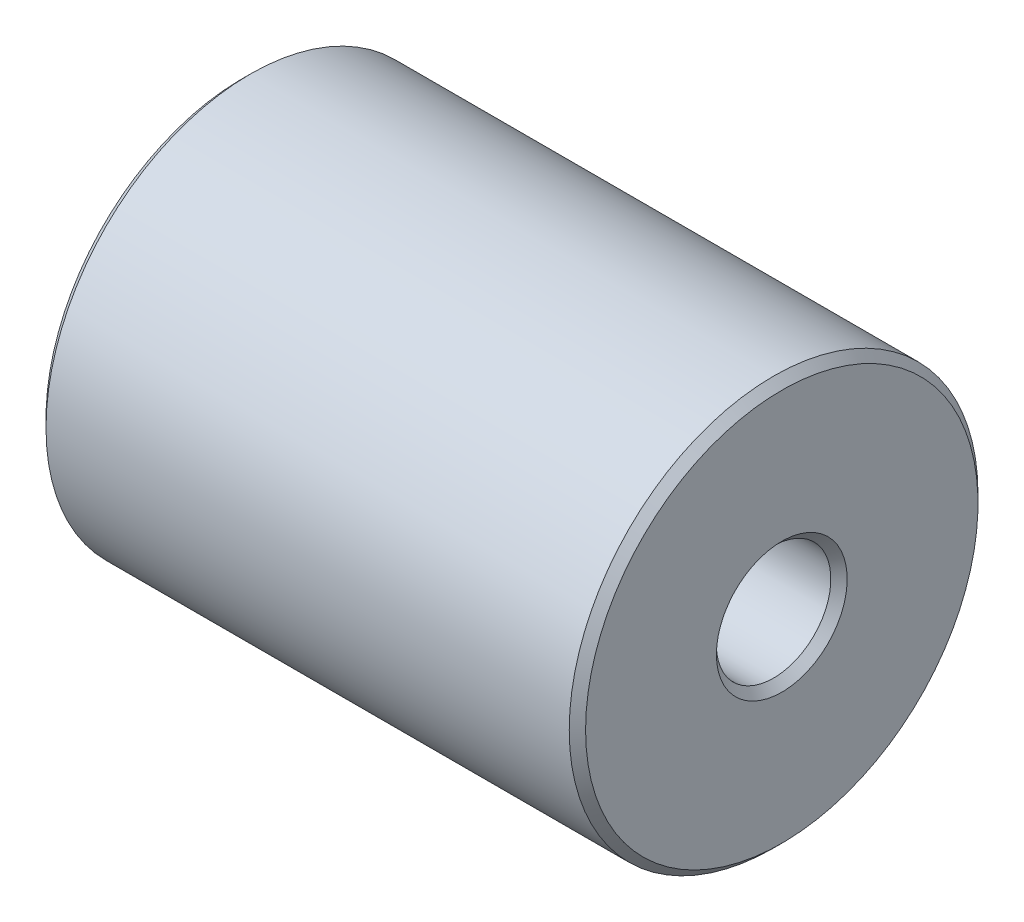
ISO-10303-21;
HEADER;
FILE_DESCRIPTION(('STEP AP214'),'2;1');
FILE_NAME('part.step','',(''),(''),'','','');
FILE_SCHEMA(('AUTOMOTIVE_DESIGN { 1 0 10303 214 1 1 1 1 }'));
ENDSEC;
DATA;
#1=APPLICATION_CONTEXT('core data for automotive mechanical design processes');
#2=APPLICATION_PROTOCOL_DEFINITION('international standard','automotive_design',2000,#1);
#3=PRODUCT_CONTEXT('',#1,'mechanical');
#4=PRODUCT('Part','Part','',(#3));
#5=PRODUCT_RELATED_PRODUCT_CATEGORY('part','',(#4));
#6=PRODUCT_DEFINITION_FORMATION('','',#4);
#7=PRODUCT_DEFINITION_CONTEXT('part definition',#1,'design');
#8=PRODUCT_DEFINITION('design','',#6,#7);
#9=PRODUCT_DEFINITION_SHAPE('','',#8);
#10=(LENGTH_UNIT() NAMED_UNIT(*) SI_UNIT(.MILLI.,.METRE.));
#11=(NAMED_UNIT(*) PLANE_ANGLE_UNIT() SI_UNIT($,.RADIAN.));
#12=(NAMED_UNIT(*) SI_UNIT($,.STERADIAN.) SOLID_ANGLE_UNIT());
#13=UNCERTAINTY_MEASURE_WITH_UNIT(LENGTH_MEASURE(1.E-05),#10,'distance_accuracy_value','');
#14=(GEOMETRIC_REPRESENTATION_CONTEXT(3) GLOBAL_UNCERTAINTY_ASSIGNED_CONTEXT((#13)) GLOBAL_UNIT_ASSIGNED_CONTEXT((#10,
#11,#12)) REPRESENTATION_CONTEXT('',''));
#15=CARTESIAN_POINT('',(0.,0.,0.));
#16=DIRECTION('',(0.,0.,1.));
#17=DIRECTION('',(1.,0.,0.));
#18=AXIS2_PLACEMENT_3D('',#15,#16,#17);
#19=CARTESIAN_POINT('',(0.,0.,0.));
#20=DIRECTION('',(-1.,0.,0.));
#21=DIRECTION('',(0.,0.,1.));
#22=AXIS2_PLACEMENT_3D('',#19,#20,#21);
#23=CYLINDRICAL_SURFACE('',#22,10.);
#24=CARTESIAN_POINT('',(1.,0.,0.));
#25=DIRECTION('',(1.,0.,0.));
#26=DIRECTION('',(0.,0.,-1.));
#27=AXIS2_PLACEMENT_3D('',#24,#25,#26);
#28=CIRCLE('',#27,10.);
#29=CARTESIAN_POINT('',(1.,0.,-10.));
#30=VERTEX_POINT('',#29);
#31=EDGE_CURVE('E25',#30,#30,#28,.F.);
#32=ORIENTED_EDGE('',*,*,#31,.T.);
#33=EDGE_LOOP('',(#32));
#34=FACE_BOUND('',#33,.T.);
#35=CARTESIAN_POINT('',(14.,0.,0.));
#36=DIRECTION('',(-1.,0.,0.));
#37=DIRECTION('',(0.,0.,1.));
#38=AXIS2_PLACEMENT_3D('',#35,#36,#37);
#39=CIRCLE('',#38,10.);
#40=CARTESIAN_POINT('',(14.,0.,10.));
#41=VERTEX_POINT('',#40);
#42=EDGE_CURVE('E49',#41,#41,#39,.T.);
#43=ORIENTED_EDGE('',*,*,#42,.F.);
#44=EDGE_LOOP('',(#43));
#45=FACE_BOUND('',#44,.T.);
#46=ADVANCED_FACE('F14',(#34,#45),#23,.F.);
#47=CARTESIAN_POINT('',(0.,10.,0.));
#48=DIRECTION('',(1.,0.,0.));
#49=DIRECTION('',(0.,0.,-1.));
#50=AXIS2_PLACEMENT_3D('',#47,#48,#49);
#51=PLANE('',#50);
#52=CARTESIAN_POINT('',(0.,0.,0.));
#53=DIRECTION('',(1.,0.,0.));
#54=DIRECTION('',(0.,0.,-1.));
#55=AXIS2_PLACEMENT_3D('',#52,#53,#54);
#56=CIRCLE('',#55,24.);
#57=CARTESIAN_POINT('',(0.,0.,-24.));
#58=VERTEX_POINT('',#57);
#59=EDGE_CURVE('E34',#58,#58,#56,.F.);
#60=ORIENTED_EDGE('',*,*,#59,.T.);
#61=EDGE_LOOP('',(#60));
#62=FACE_BOUND('',#61,.T.);
#63=CARTESIAN_POINT('',(0.,0.,0.));
#64=DIRECTION('',(1.,0.,0.));
#65=DIRECTION('',(0.,0.,-1.));
#66=AXIS2_PLACEMENT_3D('',#63,#64,#65);
#67=CIRCLE('',#66,11.);
#68=CARTESIAN_POINT('',(0.,0.,-11.));
#69=VERTEX_POINT('',#68);
#70=EDGE_CURVE('E37',#69,#69,#67,.T.);
#71=ORIENTED_EDGE('',*,*,#70,.T.);
#72=EDGE_LOOP('',(#71));
#73=FACE_BOUND('',#72,.T.);
#74=ADVANCED_FACE('F56',(#62,#73),#51,.F.);
#75=CARTESIAN_POINT('',(0.,0.,0.));
#76=DIRECTION('',(-1.,0.,0.));
#77=DIRECTION('',(0.,0.,1.));
#78=AXIS2_PLACEMENT_3D('',#75,#76,#77);
#79=CYLINDRICAL_SURFACE('',#78,25.);
#80=CARTESIAN_POINT('',(1.,0.,0.));
#81=DIRECTION('',(1.,0.,0.));
#82=DIRECTION('',(0.,0.,-1.));
#83=AXIS2_PLACEMENT_3D('',#80,#81,#82);
#84=CIRCLE('',#83,25.);
#85=CARTESIAN_POINT('',(1.,0.,-25.));
#86=VERTEX_POINT('',#85);
#87=EDGE_CURVE('E29',#86,#86,#84,.T.);
#88=ORIENTED_EDGE('',*,*,#87,.T.);
#89=EDGE_LOOP('',(#88));
#90=FACE_BOUND('',#89,.T.);
#91=CARTESIAN_POINT('',(65.,0.,0.));
#92=DIRECTION('',(-1.,0.,0.));
#93=DIRECTION('',(0.,0.,1.));
#94=AXIS2_PLACEMENT_3D('',#91,#92,#93);
#95=CIRCLE('',#94,25.);
#96=CARTESIAN_POINT('',(65.,0.,25.));
#97=VERTEX_POINT('',#96);
#98=EDGE_CURVE('E43',#97,#97,#95,.T.);
#99=ORIENTED_EDGE('',*,*,#98,.T.);
#100=EDGE_LOOP('',(#99));
#101=FACE_BOUND('',#100,.T.);
#102=ADVANCED_FACE('F64',(#90,#101),#79,.T.);
#103=CARTESIAN_POINT('',(66.,25.,0.));
#104=DIRECTION('',(-1.,0.,0.));
#105=DIRECTION('',(0.,0.,1.));
#106=AXIS2_PLACEMENT_3D('',#103,#104,#105);
#107=PLANE('',#106);
#108=CARTESIAN_POINT('',(66.,0.,0.));
#109=DIRECTION('',(-1.,0.,0.));
#110=DIRECTION('',(0.,0.,1.));
#111=AXIS2_PLACEMENT_3D('',#108,#109,#110);
#112=CIRCLE('',#111,8.);
#113=CARTESIAN_POINT('',(66.,0.,8.));
#114=VERTEX_POINT('',#113);
#115=EDGE_CURVE('E21',#114,#114,#112,.T.);
#116=ORIENTED_EDGE('',*,*,#115,.T.);
#117=EDGE_LOOP('',(#116));
#118=FACE_BOUND('',#117,.T.);
#119=CARTESIAN_POINT('',(66.,0.,0.));
#120=DIRECTION('',(-1.,0.,0.));
#121=DIRECTION('',(0.,0.,1.));
#122=AXIS2_PLACEMENT_3D('',#119,#120,#121);
#123=CIRCLE('',#122,24.);
#124=CARTESIAN_POINT('',(66.,0.,24.));
#125=VERTEX_POINT('',#124);
#126=EDGE_CURVE('E40',#125,#125,#123,.F.);
#127=ORIENTED_EDGE('',*,*,#126,.T.);
#128=EDGE_LOOP('',(#127));
#129=FACE_BOUND('',#128,.T.);
#130=ADVANCED_FACE('F110',(#118,#129),#107,.F.);
#131=CARTESIAN_POINT('',(0.,0.,0.));
#132=DIRECTION('',(-1.,0.,0.));
#133=DIRECTION('',(0.,0.,1.));
#134=AXIS2_PLACEMENT_3D('',#131,#132,#133);
#135=CYLINDRICAL_SURFACE('',#134,7.);
#136=CARTESIAN_POINT('',(65.,0.,0.));
#137=DIRECTION('',(-1.,0.,0.));
#138=DIRECTION('',(0.,0.,1.));
#139=AXIS2_PLACEMENT_3D('',#136,#137,#138);
#140=CIRCLE('',#139,7.);
#141=CARTESIAN_POINT('',(65.,0.,7.));
#142=VERTEX_POINT('',#141);
#143=EDGE_CURVE('E9',#142,#142,#140,.F.);
#144=ORIENTED_EDGE('',*,*,#143,.T.);
#145=EDGE_LOOP('',(#144));
#146=FACE_BOUND('',#145,.T.);
#147=CARTESIAN_POINT('',(14.,0.,0.));
#148=DIRECTION('',(-1.,0.,0.));
#149=DIRECTION('',(0.,0.,1.));
#150=AXIS2_PLACEMENT_3D('',#147,#148,#149);
#151=CIRCLE('',#150,7.);
#152=CARTESIAN_POINT('',(14.,0.,7.));
#153=VERTEX_POINT('',#152);
#154=EDGE_CURVE('E46',#153,#153,#151,.T.);
#155=ORIENTED_EDGE('',*,*,#154,.T.);
#156=EDGE_LOOP('',(#155));
#157=FACE_BOUND('',#156,.T.);
#158=ADVANCED_FACE('F105',(#146,#157),#135,.F.);
#159=CARTESIAN_POINT('',(14.,10.,0.));
#160=DIRECTION('',(1.,0.,0.));
#161=DIRECTION('',(0.,0.,-1.));
#162=AXIS2_PLACEMENT_3D('',#159,#160,#161);
#163=PLANE('',#162);
#164=ORIENTED_EDGE('',*,*,#154,.F.);
#165=EDGE_LOOP('',(#164));
#166=FACE_BOUND('',#165,.T.);
#167=ORIENTED_EDGE('',*,*,#42,.T.);
#168=EDGE_LOOP('',(#167));
#169=FACE_BOUND('',#168,.T.);
#170=ADVANCED_FACE('F53',(#166,#169),#163,.F.);
#171=CARTESIAN_POINT('',(65.,0.,0.));
#172=DIRECTION('',(-1.,0.,0.));
#173=DIRECTION('',(0.,0.,1.));
#174=AXIS2_PLACEMENT_3D('',#171,#172,#173);
#175=CONICAL_SURFACE('',#174,25.,0.785398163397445);
#176=ORIENTED_EDGE('',*,*,#126,.F.);
#177=EDGE_LOOP('',(#176));
#178=FACE_BOUND('',#177,.T.);
#179=ORIENTED_EDGE('',*,*,#98,.F.);
#180=EDGE_LOOP('',(#179));
#181=FACE_BOUND('',#180,.T.);
#182=ADVANCED_FACE('F69',(#178,#181),#175,.T.);
#183=CARTESIAN_POINT('',(0.,0.,0.));
#184=DIRECTION('',(1.,0.,0.));
#185=DIRECTION('',(0.,0.,-1.));
#186=AXIS2_PLACEMENT_3D('',#183,#184,#185);
#187=CONICAL_SURFACE('',#186,24.,0.785398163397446);
#188=ORIENTED_EDGE('',*,*,#87,.F.);
#189=EDGE_LOOP('',(#188));
#190=FACE_BOUND('',#189,.T.);
#191=ORIENTED_EDGE('',*,*,#59,.F.);
#192=EDGE_LOOP('',(#191));
#193=FACE_BOUND('',#192,.T.);
#194=ADVANCED_FACE('F72',(#190,#193),#187,.T.);
#195=CARTESIAN_POINT('',(1.,0.,0.));
#196=DIRECTION('',(-1.,0.,0.));
#197=DIRECTION('',(0.,0.,1.));
#198=AXIS2_PLACEMENT_3D('',#195,#196,#197);
#199=CONICAL_SURFACE('',#198,10.,0.785398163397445);
#200=ORIENTED_EDGE('',*,*,#70,.F.);
#201=EDGE_LOOP('',(#200));
#202=FACE_BOUND('',#201,.T.);
#203=ORIENTED_EDGE('',*,*,#31,.F.);
#204=EDGE_LOOP('',(#203));
#205=FACE_BOUND('',#204,.T.);
#206=ADVANCED_FACE('F75',(#202,#205),#199,.F.);
#207=CARTESIAN_POINT('',(66.,0.,0.));
#208=DIRECTION('',(1.,0.,0.));
#209=DIRECTION('',(0.,0.,-1.));
#210=AXIS2_PLACEMENT_3D('',#207,#208,#209);
#211=CONICAL_SURFACE('',#210,8.,0.785398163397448);
#212=ORIENTED_EDGE('',*,*,#143,.F.);
#213=EDGE_LOOP('',(#212));
#214=FACE_BOUND('',#213,.T.);
#215=ORIENTED_EDGE('',*,*,#115,.F.);
#216=EDGE_LOOP('',(#215));
#217=FACE_BOUND('',#216,.T.);
#218=ADVANCED_FACE('F16',(#214,#217),#211,.F.);
#219=CLOSED_SHELL('',(#46,#74,#102,#130,#158,#170,#182,#194,#206,#218));
#220=MANIFOLD_SOLID_BREP('B1',#219);
#221=ADVANCED_BREP_SHAPE_REPRESENTATION('',(#18,#220),#14);
#222=SHAPE_DEFINITION_REPRESENTATION(#9,#221);
ENDSEC;
END-ISO-10303-21;
